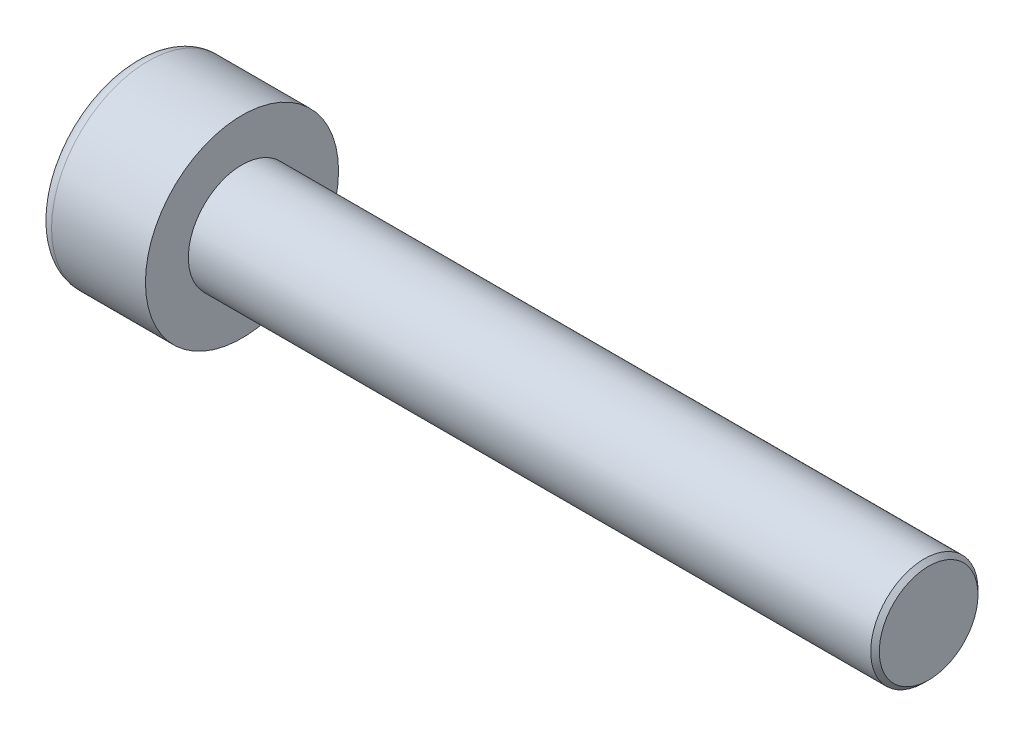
from build123d import *

# Parameters (mm, degrees)
SKETCH1_R           = 2.25
BASEHEAD_DEPTH      = 2.5
SKETCH2_R           = 1.25
BASEBODY_DEPTH      = 16
HEXAGONSOCKET_DEPTH = 1.1
TOPFILLET_R         = 0.3125
CHAMFER1_SIZE       = 0.1


with BuildPart() as part:
    # Sketch1 → BaseHead (new body)
    with BuildSketch(Plane(origin=(0, 0, 0), x_dir=(0, 0, -1), z_dir=(1, 0, 0))):
        Circle(SKETCH1_R)
    extrude(amount=BASEHEAD_DEPTH)

    # Sketch2 → BaseBody (add)
    with BuildSketch(Plane(origin=(2.5, 0, 0), x_dir=(0, 0, -1), z_dir=(1, 0, 0))):
        Circle(SKETCH2_R)
    extrude(amount=BASEBODY_DEPTH)

    # Sketch3 → HexagonSocket (cut)
    with BuildSketch(Plane(origin=(0, 0, 0), x_dir=(0, 0, -1), z_dir=(1, 0, 0))):
        Polygon((1.154700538, 0), (0.577350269, 1), (-0.577350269, 1), (-1.154700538, 0), (-0.577350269, -1), (0.577350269, -1), align=None)
    extrude(amount=HEXAGONSOCKET_DEPTH, mode=Mode.SUBTRACT)

    # Sketch4 → Cut-Revolve1 (revolve, cut)
    with BuildSketch(Plane(origin=(-4.19613823, 0.75, 0), x_dir=(-1, 0, 0), z_dir=(0, 0, 1)), mode=Mode.PRIVATE) as cut_revolve1_sk:
        Polygon((-5.29613823, 1.75), (-5.873488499, 0.75), (-5.29613823, 0.75), align=None)
    revolve(cut_revolve1_sk.sketch.rotate(Axis((0.838992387, 0, 0), (-1, 0, 0)), 90), axis=Axis((0.838992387, 0, 0), (-1, 0, 0)), mode=Mode.SUBTRACT)

    # TopFillet
    topfillet_edges = [part.edges().sort_by_distance(p)[0] for p in [
        (0, 0, 2.25),
    ]]
    fillet(topfillet_edges, radius=TOPFILLET_R)

    # Chamfer1
    chamfer1_edges = [part.edges().sort_by_distance(p)[0] for p in [
        (18.5, 0, 1.25),
    ]]
    chamfer(chamfer1_edges, length=CHAMFER1_SIZE)


solid = part.part
